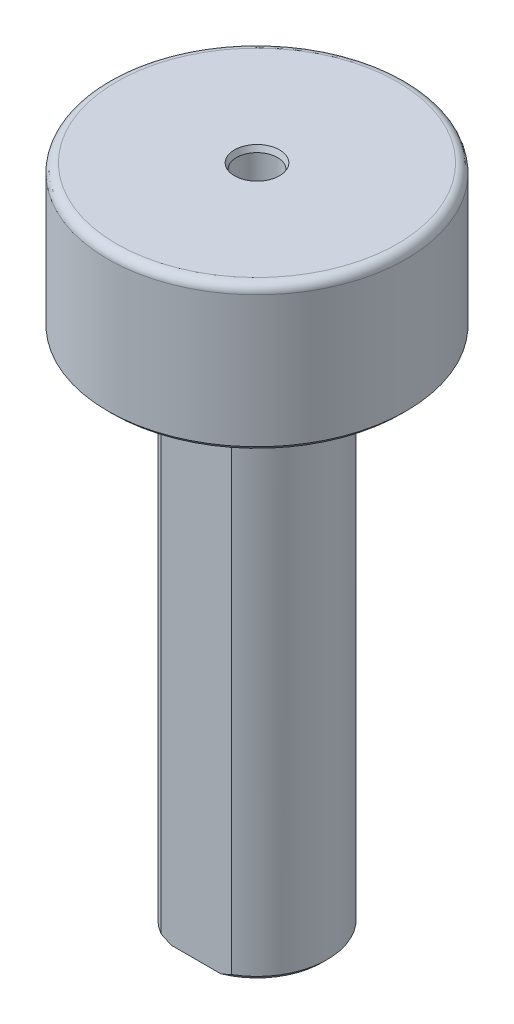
ISO-10303-21;
HEADER;
FILE_DESCRIPTION(('STEP AP214'),'2;1');
FILE_NAME('part.step','',(''),(''),'','','');
FILE_SCHEMA(('AUTOMOTIVE_DESIGN { 1 0 10303 214 1 1 1 1 }'));
ENDSEC;
DATA;
#1=APPLICATION_CONTEXT('core data for automotive mechanical design processes');
#2=APPLICATION_PROTOCOL_DEFINITION('international standard','automotive_design',2000,#1);
#3=PRODUCT_CONTEXT('',#1,'mechanical');
#4=PRODUCT('Part','Part','',(#3));
#5=PRODUCT_RELATED_PRODUCT_CATEGORY('part','',(#4));
#6=PRODUCT_DEFINITION_FORMATION('','',#4);
#7=PRODUCT_DEFINITION_CONTEXT('part definition',#1,'design');
#8=PRODUCT_DEFINITION('design','',#6,#7);
#9=PRODUCT_DEFINITION_SHAPE('','',#8);
#10=(LENGTH_UNIT() NAMED_UNIT(*) SI_UNIT(.MILLI.,.METRE.));
#11=(NAMED_UNIT(*) PLANE_ANGLE_UNIT() SI_UNIT($,.RADIAN.));
#12=(NAMED_UNIT(*) SI_UNIT($,.STERADIAN.) SOLID_ANGLE_UNIT());
#13=UNCERTAINTY_MEASURE_WITH_UNIT(LENGTH_MEASURE(1.E-05),#10,'distance_accuracy_value','');
#14=(GEOMETRIC_REPRESENTATION_CONTEXT(3) GLOBAL_UNCERTAINTY_ASSIGNED_CONTEXT((#13)) GLOBAL_UNIT_ASSIGNED_CONTEXT((#10,
#11,#12)) REPRESENTATION_CONTEXT('',''));
#15=CARTESIAN_POINT('',(0.,0.,0.));
#16=DIRECTION('',(0.,0.,1.));
#17=DIRECTION('',(1.,0.,0.));
#18=AXIS2_PLACEMENT_3D('',#15,#16,#17);
#19=CARTESIAN_POINT('',(0.,-179.07,0.));
#20=DIRECTION('',(0.,1.,0.));
#21=DIRECTION('',(0.,0.,1.));
#22=AXIS2_PLACEMENT_3D('',#19,#20,#21);
#23=PLANE('',#22);
#24=CARTESIAN_POINT('',(0.,-179.07,0.));
#25=DIRECTION('',(0.,1.,0.));
#26=DIRECTION('',(0.,0.,1.));
#27=AXIS2_PLACEMENT_3D('',#24,#25,#26);
#28=CIRCLE('',#27,17.78);
#29=CARTESIAN_POINT('',(-6.62959463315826,-179.07,16.4977839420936));
#30=VERTEX_POINT('',#29);
#31=CARTESIAN_POINT('',(6.62959463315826,-179.07,16.4977839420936));
#32=VERTEX_POINT('',#31);
#33=EDGE_CURVE('E117',#30,#32,#28,.F.);
#34=ORIENTED_EDGE('',*,*,#33,.T.);
#35=DIRECTION('',(1.,0.,0.));
#36=VECTOR('',#35,1.);
#37=CARTESIAN_POINT('',(9.52500000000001,-179.07,16.4977839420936));
#38=LINE('',#37,#36);
#39=EDGE_CURVE('E52',#30,#32,#38,.T.);
#40=ORIENTED_EDGE('',*,*,#39,.F.);
#41=EDGE_LOOP('',(#34,#40));
#42=FACE_BOUND('',#41,.T.);
#43=ADVANCED_FACE('F34',(#42),#23,.F.);
#44=CARTESIAN_POINT('',(0.,0.,0.));
#45=DIRECTION('',(0.,1.,0.));
#46=DIRECTION('',(0.,0.,1.));
#47=AXIS2_PLACEMENT_3D('',#44,#45,#46);
#48=CYLINDRICAL_SURFACE('',#47,19.05);
#49=CARTESIAN_POINT('',(0.,-177.8,0.));
#50=DIRECTION('',(0.,1.,0.));
#51=DIRECTION('',(0.,0.,1.));
#52=AXIS2_PLACEMENT_3D('',#49,#50,#51);
#53=CIRCLE('',#52,19.05);
#54=CARTESIAN_POINT('',(9.52500000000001,-177.8,16.4977839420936));
#55=VERTEX_POINT('',#54);
#56=CARTESIAN_POINT('',(-9.52500000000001,-177.8,16.4977839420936));
#57=VERTEX_POINT('',#56);
#58=EDGE_CURVE('E85',#55,#57,#53,.T.);
#59=ORIENTED_EDGE('',*,*,#58,.T.);
#60=DIRECTION('',(0.,-1.,0.));
#61=VECTOR('',#60,1.);
#62=CARTESIAN_POINT('',(-9.52500000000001,-52.07,16.4977839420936));
#63=LINE('',#62,#61);
#64=CARTESIAN_POINT('',(-9.52500000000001,-52.07,16.4977839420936));
#65=VERTEX_POINT('',#64);
#66=EDGE_CURVE('E77',#65,#57,#63,.T.);
#67=ORIENTED_EDGE('',*,*,#66,.F.);
#68=CARTESIAN_POINT('',(0.,-52.07,0.));
#69=DIRECTION('',(0.,-1.,0.));
#70=DIRECTION('',(0.,0.,-1.));
#71=AXIS2_PLACEMENT_3D('',#68,#69,#70);
#72=CIRCLE('',#71,19.05);
#73=CARTESIAN_POINT('',(9.52500000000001,-52.07,16.4977839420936));
#74=VERTEX_POINT('',#73);
#75=EDGE_CURVE('E69',#74,#65,#72,.T.);
#76=ORIENTED_EDGE('',*,*,#75,.F.);
#77=DIRECTION('',(0.,-1.,0.));
#78=VECTOR('',#77,1.);
#79=CARTESIAN_POINT('',(9.52500000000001,-52.07,16.4977839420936));
#80=LINE('',#79,#78);
#81=EDGE_CURVE('E79',#74,#55,#80,.T.);
#82=ORIENTED_EDGE('',*,*,#81,.T.);
#83=EDGE_LOOP('',(#59,#67,#76,#82));
#84=FACE_BOUND('',#83,.T.);
#85=CARTESIAN_POINT('',(0.,-6.35000000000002,0.));
#86=DIRECTION('',(0.,1.,0.));
#87=DIRECTION('',(0.,0.,1.));
#88=AXIS2_PLACEMENT_3D('',#85,#86,#87);
#89=CIRCLE('',#88,19.05);
#90=CARTESIAN_POINT('',(0.,-6.35000000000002,19.05));
#91=VERTEX_POINT('',#90);
#92=EDGE_CURVE('E101',#91,#91,#89,.T.);
#93=ORIENTED_EDGE('',*,*,#92,.F.);
#94=EDGE_LOOP('',(#93));
#95=FACE_BOUND('',#94,.T.);
#96=ADVANCED_FACE('F82',(#84,#95),#48,.T.);
#97=CARTESIAN_POINT('',(32.8930000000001,-6.35000000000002,0.));
#98=DIRECTION('',(0.,1.,0.));
#99=DIRECTION('',(0.,0.,1.));
#100=AXIS2_PLACEMENT_3D('',#97,#98,#99);
#101=PLANE('',#100);
#102=CARTESIAN_POINT('',(0.,-6.35000000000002,0.));
#103=DIRECTION('',(0.,1.,0.));
#104=DIRECTION('',(0.,0.,1.));
#105=AXIS2_PLACEMENT_3D('',#102,#103,#104);
#106=CIRCLE('',#105,32.893);
#107=CARTESIAN_POINT('',(0.,-6.35000000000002,32.893));
#108=VERTEX_POINT('',#107);
#109=EDGE_CURVE('E98',#108,#108,#106,.T.);
#110=ORIENTED_EDGE('',*,*,#109,.F.);
#111=EDGE_LOOP('',(#110));
#112=FACE_BOUND('',#111,.T.);
#113=ORIENTED_EDGE('',*,*,#92,.T.);
#114=EDGE_LOOP('',(#113));
#115=FACE_BOUND('',#114,.T.);
#116=ADVANCED_FACE('F158',(#112,#115),#101,.F.);
#117=CARTESIAN_POINT('',(0.,0.,0.));
#118=DIRECTION('',(0.,1.,0.));
#119=DIRECTION('',(0.,0.,1.));
#120=AXIS2_PLACEMENT_3D('',#117,#118,#119);
#121=CYLINDRICAL_SURFACE('',#120,32.893);
#122=CARTESIAN_POINT('',(0.,-38.1,0.));
#123=DIRECTION('',(0.,1.,0.));
#124=DIRECTION('',(0.,0.,1.));
#125=AXIS2_PLACEMENT_3D('',#122,#123,#124);
#126=CIRCLE('',#125,32.893);
#127=CARTESIAN_POINT('',(0.,-38.1,32.893));
#128=VERTEX_POINT('',#127);
#129=EDGE_CURVE('E110',#128,#128,#126,.F.);
#130=ORIENTED_EDGE('',*,*,#129,.T.);
#131=EDGE_LOOP('',(#130));
#132=FACE_BOUND('',#131,.T.);
#133=ORIENTED_EDGE('',*,*,#109,.T.);
#134=EDGE_LOOP('',(#133));
#135=FACE_BOUND('',#134,.T.);
#136=ADVANCED_FACE('F164',(#132,#135),#121,.F.);
#137=CARTESIAN_POINT('',(40.513,-39.37,0.));
#138=DIRECTION('',(0.,1.,0.));
#139=DIRECTION('',(0.,0.,1.));
#140=AXIS2_PLACEMENT_3D('',#137,#138,#139);
#141=PLANE('',#140);
#142=CARTESIAN_POINT('',(0.,-39.37,0.));
#143=DIRECTION('',(0.,1.,0.));
#144=DIRECTION('',(0.,0.,1.));
#145=AXIS2_PLACEMENT_3D('',#142,#143,#144);
#146=CIRCLE('',#145,34.163);
#147=CARTESIAN_POINT('',(0.,-39.37,34.163));
#148=VERTEX_POINT('',#147);
#149=EDGE_CURVE('E107',#148,#148,#146,.T.);
#150=ORIENTED_EDGE('',*,*,#149,.T.);
#151=EDGE_LOOP('',(#150));
#152=FACE_BOUND('',#151,.T.);
#153=CARTESIAN_POINT('',(0.,-39.37,0.));
#154=DIRECTION('',(0.,1.,0.));
#155=DIRECTION('',(0.,0.,1.));
#156=AXIS2_PLACEMENT_3D('',#153,#154,#155);
#157=CIRCLE('',#156,39.243);
#158=CARTESIAN_POINT('',(0.,-39.37,39.243));
#159=VERTEX_POINT('',#158);
#160=EDGE_CURVE('E104',#159,#159,#157,.F.);
#161=ORIENTED_EDGE('',*,*,#160,.T.);
#162=EDGE_LOOP('',(#161));
#163=FACE_BOUND('',#162,.T.);
#164=ADVANCED_FACE('F170',(#152,#163),#141,.F.);
#165=CARTESIAN_POINT('',(0.,0.,0.));
#166=DIRECTION('',(0.,1.,0.));
#167=DIRECTION('',(0.,0.,1.));
#168=AXIS2_PLACEMENT_3D('',#165,#166,#167);
#169=CYLINDRICAL_SURFACE('',#168,40.513);
#170=CARTESIAN_POINT('',(0.,-38.1,0.));
#171=DIRECTION('',(0.,1.,0.));
#172=DIRECTION('',(0.,0.,1.));
#173=AXIS2_PLACEMENT_3D('',#170,#171,#172);
#174=CIRCLE('',#173,40.513);
#175=CARTESIAN_POINT('',(0.,-38.1,40.513));
#176=VERTEX_POINT('',#175);
#177=EDGE_CURVE('E113',#176,#176,#174,.T.);
#178=ORIENTED_EDGE('',*,*,#177,.T.);
#179=EDGE_LOOP('',(#178));
#180=FACE_BOUND('',#179,.T.);
#181=CARTESIAN_POINT('',(0.,-2.38759999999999,0.));
#182=DIRECTION('',(0.,1.,0.));
#183=DIRECTION('',(0.,0.,1.));
#184=AXIS2_PLACEMENT_3D('',#181,#182,#183);
#185=CIRCLE('',#184,40.513);
#186=CARTESIAN_POINT('',(0.,-2.38759999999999,40.513));
#187=VERTEX_POINT('',#186);
#188=EDGE_CURVE('E95',#187,#187,#185,.T.);
#189=ORIENTED_EDGE('',*,*,#188,.F.);
#190=EDGE_LOOP('',(#189));
#191=FACE_BOUND('',#190,.T.);
#192=ADVANCED_FACE('F174',(#180,#191),#169,.T.);
#193=CARTESIAN_POINT('',(0.,-2.38759999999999,0.));
#194=DIRECTION('',(0.,1.,0.));
#195=DIRECTION('',(0.,0.,1.));
#196=AXIS2_PLACEMENT_3D('',#193,#194,#195);
#197=TOROIDAL_SURFACE('',#196,38.1254,2.3876);
#198=CARTESIAN_POINT('',(0.,0.,0.));
#199=DIRECTION('',(0.,1.,0.));
#200=DIRECTION('',(0.,0.,1.));
#201=AXIS2_PLACEMENT_3D('',#198,#199,#200);
#202=CIRCLE('',#201,38.1254);
#203=CARTESIAN_POINT('',(0.,0.,38.1254));
#204=VERTEX_POINT('',#203);
#205=EDGE_CURVE('E92',#204,#204,#202,.T.);
#206=ORIENTED_EDGE('',*,*,#205,.F.);
#207=EDGE_LOOP('',(#206));
#208=FACE_BOUND('',#207,.T.);
#209=ORIENTED_EDGE('',*,*,#188,.T.);
#210=EDGE_LOOP('',(#209));
#211=FACE_BOUND('',#210,.T.);
#212=ADVANCED_FACE('F178',(#208,#211),#197,.T.);
#213=CARTESIAN_POINT('',(0.,0.,0.));
#214=DIRECTION('',(0.,-1.,0.));
#215=DIRECTION('',(0.,0.,-1.));
#216=AXIS2_PLACEMENT_3D('',#213,#214,#215);
#217=PLANE('',#216);
#218=CARTESIAN_POINT('',(0.,0.,0.));
#219=DIRECTION('',(0.,-1.,0.));
#220=DIRECTION('',(0.,0.,-1.));
#221=AXIS2_PLACEMENT_3D('',#218,#219,#220);
#222=CIRCLE('',#221,6.1109406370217);
#223=CARTESIAN_POINT('',(0.,0.,-6.1109406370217));
#224=VERTEX_POINT('',#223);
#225=EDGE_CURVE('E123',#224,#224,#222,.T.);
#226=ORIENTED_EDGE('',*,*,#225,.T.);
#227=EDGE_LOOP('',(#226));
#228=FACE_BOUND('',#227,.T.);
#229=ORIENTED_EDGE('',*,*,#205,.T.);
#230=EDGE_LOOP('',(#229));
#231=FACE_BOUND('',#230,.T.);
#232=ADVANCED_FACE('F182',(#228,#231),#217,.F.);
#233=CARTESIAN_POINT('',(0.,-39.37,0.));
#234=DIRECTION('',(0.,-1.,0.));
#235=DIRECTION('',(0.,0.,-1.));
#236=AXIS2_PLACEMENT_3D('',#233,#234,#235);
#237=CONICAL_SURFACE('',#236,34.163,0.785398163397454);
#238=ORIENTED_EDGE('',*,*,#129,.F.);
#239=EDGE_LOOP('',(#238));
#240=FACE_BOUND('',#239,.T.);
#241=ORIENTED_EDGE('',*,*,#149,.F.);
#242=EDGE_LOOP('',(#241));
#243=FACE_BOUND('',#242,.T.);
#244=ADVANCED_FACE('F186',(#240,#243),#237,.F.);
#245=CARTESIAN_POINT('',(0.,-38.1,0.));
#246=DIRECTION('',(0.,1.,0.));
#247=DIRECTION('',(0.,0.,1.));
#248=AXIS2_PLACEMENT_3D('',#245,#246,#247);
#249=CONICAL_SURFACE('',#248,40.513,0.785398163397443);
#250=ORIENTED_EDGE('',*,*,#160,.F.);
#251=EDGE_LOOP('',(#250));
#252=FACE_BOUND('',#251,.T.);
#253=ORIENTED_EDGE('',*,*,#177,.F.);
#254=EDGE_LOOP('',(#253));
#255=FACE_BOUND('',#254,.T.);
#256=ADVANCED_FACE('F150',(#252,#255),#249,.T.);
#257=CARTESIAN_POINT('',(0.,-177.8,0.));
#258=DIRECTION('',(0.,1.,0.));
#259=DIRECTION('',(0.,0.,1.));
#260=AXIS2_PLACEMENT_3D('',#257,#258,#259);
#261=CONICAL_SURFACE('',#260,19.05,0.785398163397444);
#262=CARTESIAN_POINT('',(-20.3993324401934,-170.614344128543,16.4977839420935));
#263=CARTESIAN_POINT('',(-20.1403320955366,-170.81572389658,16.4977839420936));
#264=CARTESIAN_POINT('',(-19.8806013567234,-171.016163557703,16.4977839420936));
#265=CARTESIAN_POINT('',(-19.3595458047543,-171.414970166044,16.4977839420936));
#266=CARTESIAN_POINT('',(-19.0982209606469,-171.613337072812,16.4977839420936));
#267=CARTESIAN_POINT('',(-18.3115230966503,-172.205139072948,16.4977839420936));
#268=CARTESIAN_POINT('',(-17.7835722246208,-172.595161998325,16.4977839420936));
#269=CARTESIAN_POINT('',(-16.7155257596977,-173.367062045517,16.4977839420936));
#270=CARTESIAN_POINT('',(-16.1753679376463,-173.74885326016,16.4977839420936));
#271=CARTESIAN_POINT('',(-15.0854731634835,-174.498449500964,16.4977839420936));
#272=CARTESIAN_POINT('',(-14.5357371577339,-174.86625589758,16.4977839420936));
#273=CARTESIAN_POINT('',(-13.4478459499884,-175.569577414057,16.4977839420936));
#274=CARTESIAN_POINT('',(-12.9101491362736,-175.905798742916,16.4977839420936));
#275=CARTESIAN_POINT('',(-11.8225142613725,-176.55814738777,16.4977839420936));
#276=CARTESIAN_POINT('',(-11.2725743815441,-176.874271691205,16.4977839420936));
#277=CARTESIAN_POINT('',(-10.1602026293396,-177.480189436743,16.4977839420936));
#278=CARTESIAN_POINT('',(-9.59780813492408,-177.770051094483,16.4977839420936));
#279=CARTESIAN_POINT('',(-8.45752964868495,-178.317414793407,16.4977839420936));
#280=CARTESIAN_POINT('',(-7.8796522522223,-178.574930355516,16.4977839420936));
#281=CARTESIAN_POINT('',(-7.02320103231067,-178.921218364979,16.4977839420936));
#282=CARTESIAN_POINT('',(-6.75112280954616,-179.026151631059,16.4977839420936));
#283=CARTESIAN_POINT('',(-6.2034120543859,-179.226317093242,16.4977839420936));
#284=CARTESIAN_POINT('',(-5.92777964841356,-179.321549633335,16.4977839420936));
#285=CARTESIAN_POINT('',(-5.37320717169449,-179.501239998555,16.4977839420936));
#286=CARTESIAN_POINT('',(-5.09426930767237,-179.585704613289,16.4977839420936));
#287=CARTESIAN_POINT('',(-4.53308337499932,-179.742891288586,16.4977839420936));
#288=CARTESIAN_POINT('',(-4.25083522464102,-179.815613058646,16.4977839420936));
#289=CARTESIAN_POINT('',(-3.67832481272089,-179.949463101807,16.4977839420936));
#290=CARTESIAN_POINT('',(-3.38800907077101,-180.010363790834,16.4977839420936));
#291=CARTESIAN_POINT('',(-2.80476645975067,-180.117952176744,16.4977839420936));
#292=CARTESIAN_POINT('',(-2.51183979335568,-180.164640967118,16.4977839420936));
#293=CARTESIAN_POINT('',(-1.92299049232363,-180.243089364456,16.4977839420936));
#294=CARTESIAN_POINT('',(-1.62706113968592,-180.274798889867,16.4977839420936));
#295=CARTESIAN_POINT('',(-1.03384208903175,-180.322513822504,16.4977839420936));
#296=CARTESIAN_POINT('',(-0.736551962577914,-180.338513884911,16.4977839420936));
#297=CARTESIAN_POINT('',(-0.439019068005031,-180.346375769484,16.4977839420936));
#298=B_SPLINE_CURVE_WITH_KNOTS('',3,(#262,#263,#264,#265,#266,#267,#268,#269,#270,#271,#272,
#273,#274,#275,#276,#277,#278,#279,#280,#281,#282,#283,#284,#285,#286,#287,#288,#289,#290,#291,
#292,#293,#294,#295,#296,#297),.UNSPECIFIED.,.F.,.F.,(4,2,2,2,2,2,2,2,2,2,2,2,2,2,2,2,2,4),(0.,
0.98422906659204,1.96847730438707,3.93752716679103,5.92174706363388,7.90577201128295,
9.80791562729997,11.7103437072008,13.6076794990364,15.5042195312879,16.3789072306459,
17.2535639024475,18.1276663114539,19.001790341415,19.8913614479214,20.7808640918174,
21.6733200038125,22.5660794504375),.UNSPECIFIED.);
#299=EDGE_CURVE('E11',#57,#30,#298,.T.);
#300=ORIENTED_EDGE('',*,*,#299,.F.);
#301=ORIENTED_EDGE('',*,*,#58,.F.);
#302=CARTESIAN_POINT('',(0.439019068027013,-180.346375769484,16.4977839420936));
#303=CARTESIAN_POINT('',(0.69735247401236,-180.339533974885,16.4977839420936));
#304=CARTESIAN_POINT('',(0.955508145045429,-180.32657588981,16.4977839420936));
#305=CARTESIAN_POINT('',(1.47089752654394,-180.28876082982,16.4977839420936));
#306=CARTESIAN_POINT('',(1.72813140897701,-180.263906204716,16.4977839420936));
#307=CARTESIAN_POINT('',(2.24082218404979,-180.202675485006,16.4977839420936));
#308=CARTESIAN_POINT('',(2.49628118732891,-180.166317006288,16.4977839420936));
#309=CARTESIAN_POINT('',(3.00537992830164,-180.082587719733,16.4977839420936));
#310=CARTESIAN_POINT('',(3.25901959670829,-180.035216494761,16.4977839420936));
#311=CARTESIAN_POINT('',(4.01122986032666,-179.878605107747,16.4977839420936));
#312=CARTESIAN_POINT('',(4.50668765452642,-179.754173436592,16.4977839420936));
#313=CARTESIAN_POINT('',(5.48720421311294,-179.469960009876,16.4977839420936));
#314=CARTESIAN_POINT('',(5.97226296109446,-179.310178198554,16.4977839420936));
#315=CARTESIAN_POINT('',(6.59294390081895,-179.084119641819,16.4977839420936));
#316=CARTESIAN_POINT('',(6.73363419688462,-179.031415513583,16.4977839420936));
#317=CARTESIAN_POINT('',(6.94403694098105,-178.950493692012,16.4977839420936));
#318=CARTESIAN_POINT('',(7.01410088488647,-178.923194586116,16.4977839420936));
#319=CARTESIAN_POINT('',(7.15398992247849,-178.868000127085,16.4977839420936));
#320=CARTESIAN_POINT('',(7.22381502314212,-178.840104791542,16.4977839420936));
#321=CARTESIAN_POINT('',(7.89605025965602,-178.56829612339,16.4977839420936));
#322=CARTESIAN_POINT('',(8.48992348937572,-178.302962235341,16.4977839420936));
#323=CARTESIAN_POINT('',(9.66140569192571,-177.738330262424,16.4977839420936));
#324=CARTESIAN_POINT('',(10.239004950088,-177.439012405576,16.4977839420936));
#325=CARTESIAN_POINT('',(11.3814163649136,-176.812918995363,16.4977839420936));
#326=CARTESIAN_POINT('',(11.9461824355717,-176.486059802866,16.4977839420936));
#327=CARTESIAN_POINT('',(13.0628940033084,-175.811507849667,16.4977839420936));
#328=CARTESIAN_POINT('',(13.6148419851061,-175.463819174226,16.4977839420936));
#329=CARTESIAN_POINT('',(14.7004587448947,-174.756717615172,16.4977839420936));
#330=CARTESIAN_POINT('',(15.2342740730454,-174.397528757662,16.4977839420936));
#331=CARTESIAN_POINT('',(16.29296169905,-173.666146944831,16.4977839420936));
#332=CARTESIAN_POINT('',(16.817833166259,-173.293952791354,16.4977839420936));
#333=CARTESIAN_POINT('',(17.85585751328,-172.541944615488,16.4977839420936));
#334=CARTESIAN_POINT('',(18.3690697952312,-172.162212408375,16.4977839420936));
#335=CARTESIAN_POINT('',(19.1339677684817,-171.586240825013,16.4977839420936));
#336=CARTESIAN_POINT('',(19.3880816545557,-171.393213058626,16.4977839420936));
#337=CARTESIAN_POINT('',(19.8948048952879,-171.005201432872,16.4977839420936));
#338=CARTESIAN_POINT('',(20.1474142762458,-170.810217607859,16.4977839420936));
#339=CARTESIAN_POINT('',(20.3993324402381,-170.614344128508,16.4977839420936));
#340=B_SPLINE_CURVE_WITH_KNOTS('',3,(#302,#303,#304,#305,#306,#307,#308,#309,#310,#311,#312,
#313,#314,#315,#316,#317,#318,#319,#320,#321,#322,#323,#324,#325,#326,#327,#328,#329,#330,#331,
#332,#333,#334,#335,#336,#337,#338,#339),.UNSPECIFIED.,.F.,.F.,(4,2,2,2,2,2,2,2,2,2,2,2,2,2,2,2,
2,2,4),(0.,0.775176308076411,1.55019956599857,2.32404172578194,3.09791320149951,
4.62879411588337,6.15967744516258,6.6103810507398,6.83596030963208,7.06153292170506,
9.01124968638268,10.9621066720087,12.9191178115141,14.875746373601,16.8057400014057,
18.7359119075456,20.6510664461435,21.608400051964,22.5657168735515),.UNSPECIFIED.);
#341=EDGE_CURVE('E46',#32,#55,#340,.T.);
#342=ORIENTED_EDGE('',*,*,#341,.F.);
#343=ORIENTED_EDGE('',*,*,#33,.F.);
#344=EDGE_LOOP('',(#300,#301,#342,#343));
#345=FACE_BOUND('',#344,.T.);
#346=ADVANCED_FACE('F128',(#345),#261,.T.);
#347=CARTESIAN_POINT('',(0.,-19.05,0.));
#348=DIRECTION('',(0.,1.,0.));
#349=DIRECTION('',(0.,0.,1.));
#350=AXIS2_PLACEMENT_3D('',#347,#348,#349);
#351=CYLINDRICAL_SURFACE('',#350,5.55625);
#352=CARTESIAN_POINT('',(0.,-1.52400000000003,0.));
#353=DIRECTION('',(0.,-1.,0.));
#354=DIRECTION('',(0.,0.,-1.));
#355=AXIS2_PLACEMENT_3D('',#352,#353,#354);
#356=CIRCLE('',#355,5.55625);
#357=CARTESIAN_POINT('',(0.,-1.52400000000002,5.55625));
#358=VERTEX_POINT('',#357);
#359=EDGE_CURVE('E120',#358,#358,#356,.F.);
#360=CARTESIAN_POINT('',(0.,-19.05,0.));
#361=DIRECTION('',(0.,1.,0.));
#362=DIRECTION('',(0.,0.,1.));
#363=AXIS2_PLACEMENT_3D('',#360,#361,#362);
#364=CIRCLE('',#363,5.55625);
#365=CARTESIAN_POINT('',(0.,-19.05,5.55625));
#366=VERTEX_POINT('',#365);
#367=EDGE_CURVE('E87',#366,#366,#364,.T.);
#368=CARTESIAN_POINT('',(0.,-1.52400000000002,5.55625));
#369=CARTESIAN_POINT('',(0.,-1.70656250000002,5.55625));
#370=CARTESIAN_POINT('',(0.,-1.88912500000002,5.55625));
#371=CARTESIAN_POINT('',(0.,-2.25425000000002,5.55625));
#372=CARTESIAN_POINT('',(0.,-2.43681250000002,5.55625));
#373=CARTESIAN_POINT('',(0.,-2.80193750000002,5.55625));
#374=CARTESIAN_POINT('',(0.,-2.98450000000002,5.55625));
#375=CARTESIAN_POINT('',(0.,-3.34962500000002,5.55625));
#376=CARTESIAN_POINT('',(0.,-3.53218750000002,5.55625));
#377=CARTESIAN_POINT('',(0.,-3.89731250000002,5.55625));
#378=CARTESIAN_POINT('',(0.,-4.07987500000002,5.55625));
#379=CARTESIAN_POINT('',(0.,-4.44500000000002,5.55625));
#380=CARTESIAN_POINT('',(0.,-4.62756250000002,5.55625));
#381=CARTESIAN_POINT('',(0.,-4.99268750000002,5.55625));
#382=CARTESIAN_POINT('',(0.,-5.17525000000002,5.55625));
#383=CARTESIAN_POINT('',(0.,-5.54037500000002,5.55625));
#384=CARTESIAN_POINT('',(0.,-5.72293750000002,5.55625));
#385=CARTESIAN_POINT('',(0.,-6.08806250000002,5.55625));
#386=CARTESIAN_POINT('',(0.,-6.27062500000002,5.55625));
#387=CARTESIAN_POINT('',(0.,-6.63575000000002,5.55625));
#388=CARTESIAN_POINT('',(0.,-6.81831250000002,5.55625));
#389=CARTESIAN_POINT('',(0.,-7.18343750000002,5.55625));
#390=CARTESIAN_POINT('',(0.,-7.36600000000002,5.55625));
#391=CARTESIAN_POINT('',(0.,-7.73112500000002,5.55625));
#392=CARTESIAN_POINT('',(0.,-7.91368750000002,5.55625));
#393=CARTESIAN_POINT('',(0.,-8.27881250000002,5.55625));
#394=CARTESIAN_POINT('',(0.,-8.46137500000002,5.55625));
#395=CARTESIAN_POINT('',(0.,-8.82650000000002,5.55625));
#396=CARTESIAN_POINT('',(0.,-9.00906250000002,5.55625));
#397=CARTESIAN_POINT('',(0.,-9.37418750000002,5.55625));
#398=CARTESIAN_POINT('',(0.,-9.55675000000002,5.55625));
#399=CARTESIAN_POINT('',(0.,-9.92187500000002,5.55625));
#400=CARTESIAN_POINT('',(0.,-10.1044375,5.55625));
#401=CARTESIAN_POINT('',(0.,-10.4695625,5.55625));
#402=CARTESIAN_POINT('',(0.,-10.652125,5.55625));
#403=CARTESIAN_POINT('',(0.,-11.01725,5.55625));
#404=CARTESIAN_POINT('',(0.,-11.1998125,5.55625));
#405=CARTESIAN_POINT('',(0.,-11.5649375,5.55625));
#406=CARTESIAN_POINT('',(0.,-11.7475,5.55625));
#407=CARTESIAN_POINT('',(0.,-12.112625,5.55625));
#408=CARTESIAN_POINT('',(0.,-12.2951875,5.55625));
#409=CARTESIAN_POINT('',(0.,-12.6603125,5.55625));
#410=CARTESIAN_POINT('',(0.,-12.842875,5.55625));
#411=CARTESIAN_POINT('',(0.,-13.208,5.55625));
#412=CARTESIAN_POINT('',(0.,-13.3905625,5.55625));
#413=CARTESIAN_POINT('',(0.,-13.7556875,5.55625));
#414=CARTESIAN_POINT('',(0.,-13.93825,5.55625));
#415=CARTESIAN_POINT('',(0.,-14.303375,5.55625));
#416=CARTESIAN_POINT('',(0.,-14.4859375,5.55625));
#417=CARTESIAN_POINT('',(0.,-14.8510625,5.55625));
#418=CARTESIAN_POINT('',(0.,-15.033625,5.55625));
#419=CARTESIAN_POINT('',(0.,-15.39875,5.55625));
#420=CARTESIAN_POINT('',(0.,-15.5813125,5.55625));
#421=CARTESIAN_POINT('',(0.,-15.9464375,5.55625));
#422=CARTESIAN_POINT('',(0.,-16.129,5.55625));
#423=CARTESIAN_POINT('',(0.,-16.494125,5.55625));
#424=CARTESIAN_POINT('',(0.,-16.6766875,5.55625));
#425=CARTESIAN_POINT('',(0.,-17.0418125,5.55625));
#426=CARTESIAN_POINT('',(0.,-17.224375,5.55625));
#427=CARTESIAN_POINT('',(0.,-17.5895,5.55625));
#428=CARTESIAN_POINT('',(0.,-17.7720625,5.55625));
#429=CARTESIAN_POINT('',(0.,-18.1371875,5.55625));
#430=CARTESIAN_POINT('',(0.,-18.31975,5.55625));
#431=CARTESIAN_POINT('',(0.,-18.684875,5.55625));
#432=CARTESIAN_POINT('',(0.,-18.8674375,5.55625));
#433=CARTESIAN_POINT('',(0.,-19.05,5.55625));
#434=B_SPLINE_CURVE_WITH_KNOTS('',3,(#368,#369,#370,#371,#372,#373,#374,#375,#376,#377,#378,
#379,#380,#381,#382,#383,#384,#385,#386,#387,#388,#389,#390,#391,#392,#393,#394,#395,#396,#397,
#398,#399,#400,#401,#402,#403,#404,#405,#406,#407,#408,#409,#410,#411,#412,#413,#414,#415,#416,
#417,#418,#419,#420,#421,#422,#423,#424,#425,#426,#427,#428,#429,#430,#431,#432,#433),
.UNSPECIFIED.,.F.,.F.,(4,2,2,2,2,2,2,2,2,2,2,2,2,2,2,2,2,2,2,2,2,2,2,2,2,2,2,2,2,2,2,2,4),(0.,
0.547687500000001,1.095375,1.6430625,2.19075,2.7384375,3.286125,3.8338125,4.3815,4.9291875,
5.476875,6.0245625,6.57225,7.11993749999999,7.667625,8.2153125,8.76299999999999,
9.31068749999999,9.85837499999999,10.4060625,10.95375,11.5014375,12.049125,12.5968125,13.1445,
13.6921875,14.239875,14.7875625,15.33525,15.8829375,16.430625,16.9783125,17.526),.UNSPECIFIED.);
#435=EDGE_CURVE('BSEAM143',#358,#366,#434,.T.);
#436=ORIENTED_EDGE('',*,*,#359,.T.);
#437=ORIENTED_EDGE('',*,*,#367,.F.);
#438=ORIENTED_EDGE('',*,*,#435,.T.);
#439=ORIENTED_EDGE('',*,*,#435,.F.);
#440=EDGE_LOOP('',(#436,#438,#437,#439));
#441=FACE_BOUND('',#440,.T.);
#442=ADVANCED_FACE('F143',(#441),#351,.F.);
#443=CARTESIAN_POINT('',(0.,-19.05,0.));
#444=DIRECTION('',(0.,1.,0.));
#445=DIRECTION('',(0.,0.,1.));
#446=AXIS2_PLACEMENT_3D('',#443,#444,#445);
#447=PLANE('',#446);
#448=ORIENTED_EDGE('',*,*,#367,.T.);
#449=EDGE_LOOP('',(#448));
#450=FACE_BOUND('',#449,.T.);
#451=ADVANCED_FACE('F140',(#450),#447,.T.);
#452=CARTESIAN_POINT('',(0.,-1.52400000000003,0.));
#453=DIRECTION('',(0.,1.,0.));
#454=DIRECTION('',(0.,0.,1.));
#455=AXIS2_PLACEMENT_3D('',#452,#453,#454);
#456=CONICAL_SURFACE('',#455,5.55625,0.349065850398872);
#457=ORIENTED_EDGE('',*,*,#225,.F.);
#458=EDGE_LOOP('',(#457));
#459=FACE_BOUND('',#458,.T.);
#460=ORIENTED_EDGE('',*,*,#359,.F.);
#461=EDGE_LOOP('',(#460));
#462=FACE_BOUND('',#461,.T.);
#463=ADVANCED_FACE('F136',(#459,#462),#456,.F.);
#464=CARTESIAN_POINT('',(9.52500000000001,-52.07,16.4977839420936));
#465=DIRECTION('',(0.,0.,-1.));
#466=DIRECTION('',(-1.,0.,0.));
#467=AXIS2_PLACEMENT_3D('',#464,#465,#466);
#468=PLANE('',#467);
#469=ORIENTED_EDGE('',*,*,#299,.T.);
#470=ORIENTED_EDGE('',*,*,#39,.T.);
#471=ORIENTED_EDGE('',*,*,#341,.T.);
#472=ORIENTED_EDGE('',*,*,#81,.F.);
#473=DIRECTION('',(1.,0.,0.));
#474=VECTOR('',#473,1.);
#475=CARTESIAN_POINT('',(9.52500000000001,-52.07,16.4977839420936));
#476=LINE('',#475,#474);
#477=EDGE_CURVE('E72',#65,#74,#476,.T.);
#478=ORIENTED_EDGE('',*,*,#477,.F.);
#479=ORIENTED_EDGE('',*,*,#66,.T.);
#480=EDGE_LOOP('',(#469,#470,#471,#472,#478,#479));
#481=FACE_BOUND('',#480,.T.);
#482=ADVANCED_FACE('F76',(#481),#468,.F.);
#483=CARTESIAN_POINT('',(0.,-52.07,0.));
#484=DIRECTION('',(0.,-1.,0.));
#485=DIRECTION('',(0.,0.,-1.));
#486=AXIS2_PLACEMENT_3D('',#483,#484,#485);
#487=PLANE('',#486);
#488=ORIENTED_EDGE('',*,*,#75,.T.);
#489=ORIENTED_EDGE('',*,*,#477,.T.);
#490=EDGE_LOOP('',(#488,#489));
#491=FACE_BOUND('',#490,.T.);
#492=ADVANCED_FACE('F71',(#491),#487,.T.);
#493=CLOSED_SHELL('',(#43,#96,#116,#136,#164,#192,#212,#232,#244,#256,#346,#442,#451,#463,#482,#492));
#494=MANIFOLD_SOLID_BREP('B2',#493);
#495=ADVANCED_BREP_SHAPE_REPRESENTATION('',(#18,#494),#14);
#496=SHAPE_DEFINITION_REPRESENTATION(#9,#495);
ENDSEC;
END-ISO-10303-21;
